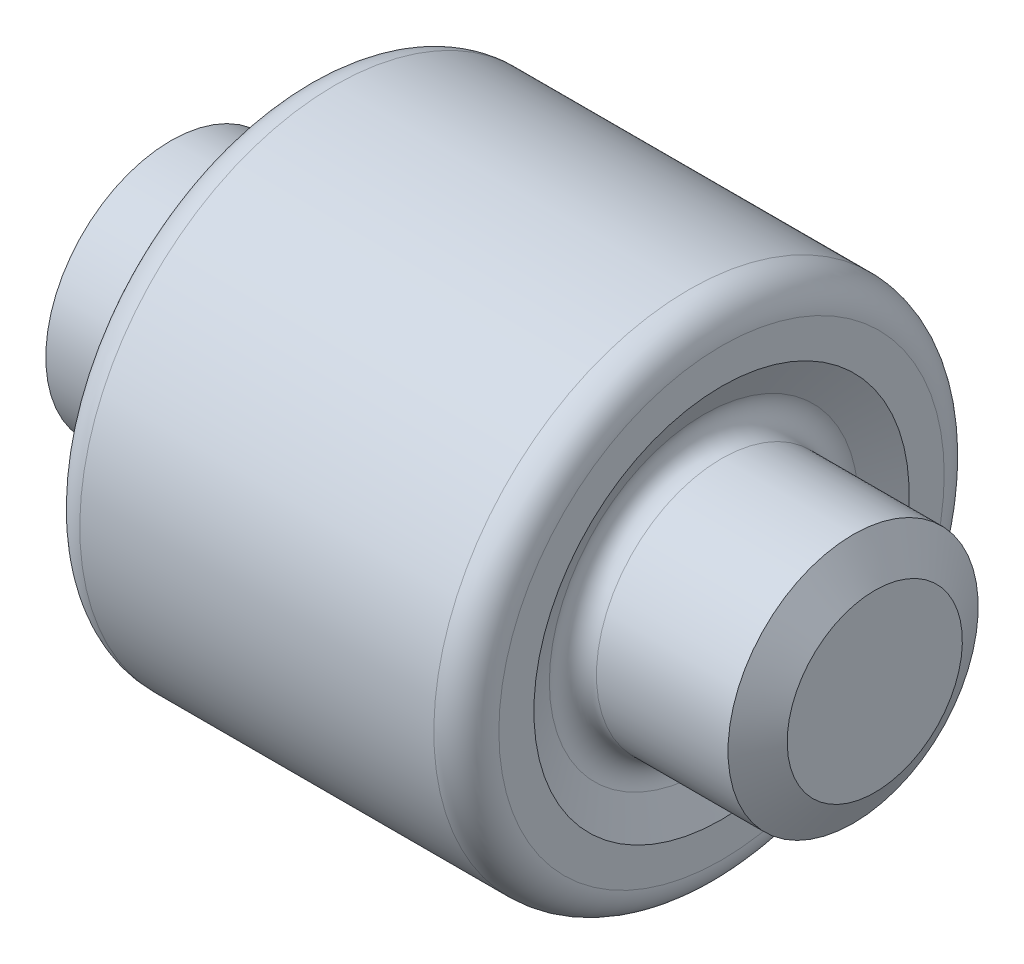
ISO-10303-21;
HEADER;
FILE_DESCRIPTION(('STEP AP214'),'2;1');
FILE_NAME('part.step','',(''),(''),'','','');
FILE_SCHEMA(('AUTOMOTIVE_DESIGN { 1 0 10303 214 1 1 1 1 }'));
ENDSEC;
DATA;
#1=APPLICATION_CONTEXT('core data for automotive mechanical design processes');
#2=APPLICATION_PROTOCOL_DEFINITION('international standard','automotive_design',2000,#1);
#3=PRODUCT_CONTEXT('',#1,'mechanical');
#4=PRODUCT('Part','Part','',(#3));
#5=PRODUCT_RELATED_PRODUCT_CATEGORY('part','',(#4));
#6=PRODUCT_DEFINITION_FORMATION('','',#4);
#7=PRODUCT_DEFINITION_CONTEXT('part definition',#1,'design');
#8=PRODUCT_DEFINITION('design','',#6,#7);
#9=PRODUCT_DEFINITION_SHAPE('','',#8);
#10=(LENGTH_UNIT() NAMED_UNIT(*) SI_UNIT(.MILLI.,.METRE.));
#11=(NAMED_UNIT(*) PLANE_ANGLE_UNIT() SI_UNIT($,.RADIAN.));
#12=(NAMED_UNIT(*) SI_UNIT($,.STERADIAN.) SOLID_ANGLE_UNIT());
#13=UNCERTAINTY_MEASURE_WITH_UNIT(LENGTH_MEASURE(1.E-05),#10,'distance_accuracy_value','');
#14=(GEOMETRIC_REPRESENTATION_CONTEXT(3) GLOBAL_UNCERTAINTY_ASSIGNED_CONTEXT((#13)) GLOBAL_UNIT_ASSIGNED_CONTEXT((#10,
#11,#12)) REPRESENTATION_CONTEXT('',''));
#15=CARTESIAN_POINT('',(0.,0.,0.));
#16=DIRECTION('',(0.,0.,1.));
#17=DIRECTION('',(1.,0.,0.));
#18=AXIS2_PLACEMENT_3D('',#15,#16,#17);
#19=CARTESIAN_POINT('',(14.5,0.,0.));
#20=DIRECTION('',(1.,0.,0.));
#21=DIRECTION('',(0.,1.,0.));
#22=AXIS2_PLACEMENT_3D('',#19,#20,#21);
#23=CYLINDRICAL_SURFACE('',#22,10.2);
#24=CARTESIAN_POINT('',(7.42499999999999,0.,0.));
#25=DIRECTION('',(1.,0.,0.));
#26=DIRECTION('',(0.,1.,0.));
#27=AXIS2_PLACEMENT_3D('',#24,#25,#26);
#28=CIRCLE('',#27,10.2);
#29=CARTESIAN_POINT('',(7.425,10.2,0.));
#30=VERTEX_POINT('',#29);
#31=EDGE_CURVE('E12',#30,#30,#28,.T.);
#32=ORIENTED_EDGE('',*,*,#31,.T.);
#33=EDGE_LOOP('',(#32));
#34=FACE_BOUND('',#33,.T.);
#35=CARTESIAN_POINT('',(21.575,0.,0.));
#36=DIRECTION('',(1.,0.,0.));
#37=DIRECTION('',(0.,1.,0.));
#38=AXIS2_PLACEMENT_3D('',#35,#36,#37);
#39=CIRCLE('',#38,10.2);
#40=CARTESIAN_POINT('',(21.575,10.2,0.));
#41=VERTEX_POINT('',#40);
#42=EDGE_CURVE('E68',#41,#41,#39,.T.);
#43=ORIENTED_EDGE('',*,*,#42,.F.);
#44=EDGE_LOOP('',(#43));
#45=FACE_BOUND('',#44,.T.);
#46=ADVANCED_FACE('F40',(#34,#45),#23,.T.);
#47=CARTESIAN_POINT('',(7.425,0.,0.));
#48=DIRECTION('',(1.,0.,0.));
#49=DIRECTION('',(0.,1.,0.));
#50=AXIS2_PLACEMENT_3D('',#47,#48,#49);
#51=TOROIDAL_SURFACE('',#50,8.9,1.3);
#52=CARTESIAN_POINT('',(6.12499999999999,0.,0.));
#53=DIRECTION('',(1.,0.,0.));
#54=DIRECTION('',(0.,1.,0.));
#55=AXIS2_PLACEMENT_3D('',#52,#53,#54);
#56=CIRCLE('',#55,8.9);
#57=CARTESIAN_POINT('',(6.125,8.9,0.));
#58=VERTEX_POINT('',#57);
#59=EDGE_CURVE('E46',#58,#58,#56,.T.);
#60=ORIENTED_EDGE('',*,*,#59,.T.);
#61=EDGE_LOOP('',(#60));
#62=FACE_BOUND('',#61,.T.);
#63=ORIENTED_EDGE('',*,*,#31,.F.);
#64=EDGE_LOOP('',(#63));
#65=FACE_BOUND('',#64,.T.);
#66=ADVANCED_FACE('F130',(#62,#65),#51,.T.);
#67=CARTESIAN_POINT('',(6.125,7.5,0.));
#68=DIRECTION('',(-1.,0.,0.));
#69=DIRECTION('',(0.,-1.,0.));
#70=AXIS2_PLACEMENT_3D('',#67,#68,#69);
#71=PLANE('',#70);
#72=CARTESIAN_POINT('',(6.12499999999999,0.,0.));
#73=DIRECTION('',(1.,0.,0.));
#74=DIRECTION('',(0.,1.,0.));
#75=AXIS2_PLACEMENT_3D('',#72,#73,#74);
#76=CIRCLE('',#75,7.5);
#77=CARTESIAN_POINT('',(6.125,7.5,0.));
#78=VERTEX_POINT('',#77);
#79=EDGE_CURVE('E50',#78,#78,#76,.T.);
#80=ORIENTED_EDGE('',*,*,#79,.T.);
#81=EDGE_LOOP('',(#80));
#82=FACE_BOUND('',#81,.T.);
#83=ORIENTED_EDGE('',*,*,#59,.F.);
#84=EDGE_LOOP('',(#83));
#85=FACE_BOUND('',#84,.T.);
#86=ADVANCED_FACE('F134',(#82,#85),#71,.T.);
#87=CARTESIAN_POINT('',(6.12499999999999,0.,0.));
#88=DIRECTION('',(-1.,0.,0.));
#89=DIRECTION('',(0.,-1.,0.));
#90=AXIS2_PLACEMENT_3D('',#87,#88,#89);
#91=CONICAL_SURFACE('',#90,7.5,1.08083900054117);
#92=CARTESIAN_POINT('',(6.83088235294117,0.,0.));
#93=DIRECTION('',(1.,0.,0.));
#94=DIRECTION('',(0.,1.,0.));
#95=AXIS2_PLACEMENT_3D('',#92,#93,#94);
#96=CIRCLE('',#95,6.1764705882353);
#97=CARTESIAN_POINT('',(6.83088235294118,6.17647058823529,0.));
#98=VERTEX_POINT('',#97);
#99=EDGE_CURVE('E54',#98,#98,#96,.T.);
#100=ORIENTED_EDGE('',*,*,#99,.T.);
#101=EDGE_LOOP('',(#100));
#102=FACE_BOUND('',#101,.T.);
#103=ORIENTED_EDGE('',*,*,#79,.F.);
#104=EDGE_LOOP('',(#103));
#105=FACE_BOUND('',#104,.T.);
#106=ADVANCED_FACE('F138',(#102,#105),#91,.F.);
#107=CARTESIAN_POINT('',(6.125,0.,0.));
#108=DIRECTION('',(1.,0.,0.));
#109=DIRECTION('',(0.,1.,0.));
#110=AXIS2_PLACEMENT_3D('',#107,#108,#109);
#111=TOROIDAL_SURFACE('',#110,5.8,0.799999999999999);
#112=CARTESIAN_POINT('',(6.125,0.,0.));
#113=DIRECTION('',(1.,0.,0.));
#114=DIRECTION('',(0.,1.,0.));
#115=AXIS2_PLACEMENT_3D('',#112,#113,#114);
#116=CIRCLE('',#115,5.);
#117=CARTESIAN_POINT('',(6.125,5.,0.));
#118=VERTEX_POINT('',#117);
#119=EDGE_CURVE('E59',#118,#118,#116,.T.);
#120=ORIENTED_EDGE('',*,*,#119,.T.);
#121=EDGE_LOOP('',(#120));
#122=FACE_BOUND('',#121,.T.);
#123=ORIENTED_EDGE('',*,*,#99,.F.);
#124=EDGE_LOOP('',(#123));
#125=FACE_BOUND('',#124,.T.);
#126=ADVANCED_FACE('F145',(#122,#125),#111,.F.);
#127=CARTESIAN_POINT('',(14.5,0.,0.));
#128=DIRECTION('',(1.,0.,0.));
#129=DIRECTION('',(0.,1.,0.));
#130=AXIS2_PLACEMENT_3D('',#127,#128,#129);
#131=CYLINDRICAL_SURFACE('',#130,5.);
#132=CARTESIAN_POINT('',(0.866025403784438,0.,0.));
#133=DIRECTION('',(1.,0.,0.));
#134=DIRECTION('',(0.,1.,0.));
#135=AXIS2_PLACEMENT_3D('',#132,#133,#134);
#136=CIRCLE('',#135,5.);
#137=CARTESIAN_POINT('',(0.86602540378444,5.,0.));
#138=VERTEX_POINT('',#137);
#139=EDGE_CURVE('E62',#138,#138,#136,.T.);
#140=ORIENTED_EDGE('',*,*,#139,.T.);
#141=EDGE_LOOP('',(#140));
#142=FACE_BOUND('',#141,.T.);
#143=ORIENTED_EDGE('',*,*,#119,.F.);
#144=EDGE_LOOP('',(#143));
#145=FACE_BOUND('',#144,.T.);
#146=ADVANCED_FACE('F149',(#142,#145),#131,.T.);
#147=CARTESIAN_POINT('',(0.866025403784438,0.,0.));
#148=DIRECTION('',(1.,0.,0.));
#149=DIRECTION('',(0.,1.,0.));
#150=AXIS2_PLACEMENT_3D('',#147,#148,#149);
#151=CONICAL_SURFACE('',#150,5.,1.0471975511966);
#152=CARTESIAN_POINT('',(0.,0.,0.));
#153=DIRECTION('',(1.,0.,0.));
#154=DIRECTION('',(0.,1.,0.));
#155=AXIS2_PLACEMENT_3D('',#152,#153,#154);
#156=CIRCLE('',#155,3.5);
#157=CARTESIAN_POINT('',(0.,3.5,0.));
#158=VERTEX_POINT('',#157);
#159=EDGE_CURVE('E65',#158,#158,#156,.T.);
#160=ORIENTED_EDGE('',*,*,#159,.T.);
#161=EDGE_LOOP('',(#160));
#162=FACE_BOUND('',#161,.T.);
#163=ORIENTED_EDGE('',*,*,#139,.F.);
#164=EDGE_LOOP('',(#163));
#165=FACE_BOUND('',#164,.T.);
#166=ADVANCED_FACE('F153',(#162,#165),#151,.T.);
#167=CARTESIAN_POINT('',(0.,0.,0.));
#168=DIRECTION('',(-1.,0.,0.));
#169=DIRECTION('',(0.,-1.,0.));
#170=AXIS2_PLACEMENT_3D('',#167,#168,#169);
#171=PLANE('',#170);
#172=ORIENTED_EDGE('',*,*,#159,.F.);
#173=EDGE_LOOP('',(#172));
#174=FACE_BOUND('',#173,.T.);
#175=ADVANCED_FACE('F125',(#174),#171,.T.);
#176=CARTESIAN_POINT('',(21.575,0.,0.));
#177=DIRECTION('',(-1.,0.,0.));
#178=DIRECTION('',(0.,1.,0.));
#179=AXIS2_PLACEMENT_3D('',#176,#177,#178);
#180=TOROIDAL_SURFACE('',#179,8.9,1.3);
#181=CARTESIAN_POINT('',(22.875,0.,0.));
#182=DIRECTION('',(1.,0.,0.));
#183=DIRECTION('',(0.,1.,0.));
#184=AXIS2_PLACEMENT_3D('',#181,#182,#183);
#185=CIRCLE('',#184,8.9);
#186=CARTESIAN_POINT('',(22.875,8.89999999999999,0.));
#187=VERTEX_POINT('',#186);
#188=EDGE_CURVE('E71',#187,#187,#185,.T.);
#189=ORIENTED_EDGE('',*,*,#188,.F.);
#190=EDGE_LOOP('',(#189));
#191=FACE_BOUND('',#190,.T.);
#192=ORIENTED_EDGE('',*,*,#42,.T.);
#193=EDGE_LOOP('',(#192));
#194=FACE_BOUND('',#193,.T.);
#195=ADVANCED_FACE('F119',(#191,#194),#180,.T.);
#196=CARTESIAN_POINT('',(22.875,7.49999999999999,0.));
#197=DIRECTION('',(1.,0.,0.));
#198=DIRECTION('',(0.,-1.,0.));
#199=AXIS2_PLACEMENT_3D('',#196,#197,#198);
#200=PLANE('',#199);
#201=CARTESIAN_POINT('',(22.875,0.,0.));
#202=DIRECTION('',(1.,0.,0.));
#203=DIRECTION('',(0.,1.,0.));
#204=AXIS2_PLACEMENT_3D('',#201,#202,#203);
#205=CIRCLE('',#204,7.5);
#206=CARTESIAN_POINT('',(22.875,7.49999999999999,0.));
#207=VERTEX_POINT('',#206);
#208=EDGE_CURVE('E74',#207,#207,#205,.T.);
#209=ORIENTED_EDGE('',*,*,#208,.F.);
#210=EDGE_LOOP('',(#209));
#211=FACE_BOUND('',#210,.T.);
#212=ORIENTED_EDGE('',*,*,#188,.T.);
#213=EDGE_LOOP('',(#212));
#214=FACE_BOUND('',#213,.T.);
#215=ADVANCED_FACE('F113',(#211,#214),#200,.T.);
#216=CARTESIAN_POINT('',(22.875,0.,0.));
#217=DIRECTION('',(1.,0.,0.));
#218=DIRECTION('',(0.,-1.,0.));
#219=AXIS2_PLACEMENT_3D('',#216,#217,#218);
#220=CONICAL_SURFACE('',#219,7.5,1.08083900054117);
#221=CARTESIAN_POINT('',(22.1691176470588,0.,0.));
#222=DIRECTION('',(1.,0.,0.));
#223=DIRECTION('',(0.,1.,0.));
#224=AXIS2_PLACEMENT_3D('',#221,#222,#223);
#225=CIRCLE('',#224,6.1764705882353);
#226=CARTESIAN_POINT('',(22.1691176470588,6.17647058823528,0.));
#227=VERTEX_POINT('',#226);
#228=EDGE_CURVE('E77',#227,#227,#225,.T.);
#229=ORIENTED_EDGE('',*,*,#228,.F.);
#230=EDGE_LOOP('',(#229));
#231=FACE_BOUND('',#230,.T.);
#232=ORIENTED_EDGE('',*,*,#208,.T.);
#233=EDGE_LOOP('',(#232));
#234=FACE_BOUND('',#233,.T.);
#235=ADVANCED_FACE('F107',(#231,#234),#220,.F.);
#236=CARTESIAN_POINT('',(22.875,0.,0.));
#237=DIRECTION('',(-1.,0.,0.));
#238=DIRECTION('',(0.,1.,0.));
#239=AXIS2_PLACEMENT_3D('',#236,#237,#238);
#240=TOROIDAL_SURFACE('',#239,5.8,0.799999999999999);
#241=CARTESIAN_POINT('',(22.875,0.,0.));
#242=DIRECTION('',(1.,0.,0.));
#243=DIRECTION('',(0.,1.,0.));
#244=AXIS2_PLACEMENT_3D('',#241,#242,#243);
#245=CIRCLE('',#244,5.);
#246=CARTESIAN_POINT('',(22.875,4.99999999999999,0.));
#247=VERTEX_POINT('',#246);
#248=EDGE_CURVE('E80',#247,#247,#245,.T.);
#249=ORIENTED_EDGE('',*,*,#248,.F.);
#250=EDGE_LOOP('',(#249));
#251=FACE_BOUND('',#250,.T.);
#252=ORIENTED_EDGE('',*,*,#228,.T.);
#253=EDGE_LOOP('',(#252));
#254=FACE_BOUND('',#253,.T.);
#255=ADVANCED_FACE('F101',(#251,#254),#240,.F.);
#256=CARTESIAN_POINT('',(14.5,0.,0.));
#257=DIRECTION('',(-1.,0.,0.));
#258=DIRECTION('',(0.,1.,0.));
#259=AXIS2_PLACEMENT_3D('',#256,#257,#258);
#260=CYLINDRICAL_SURFACE('',#259,5.);
#261=CARTESIAN_POINT('',(28.1339745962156,0.,0.));
#262=DIRECTION('',(1.,0.,0.));
#263=DIRECTION('',(0.,1.,0.));
#264=AXIS2_PLACEMENT_3D('',#261,#262,#263);
#265=CIRCLE('',#264,5.);
#266=CARTESIAN_POINT('',(28.1339745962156,4.99999999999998,0.));
#267=VERTEX_POINT('',#266);
#268=EDGE_CURVE('E83',#267,#267,#265,.T.);
#269=ORIENTED_EDGE('',*,*,#268,.F.);
#270=EDGE_LOOP('',(#269));
#271=FACE_BOUND('',#270,.T.);
#272=ORIENTED_EDGE('',*,*,#248,.T.);
#273=EDGE_LOOP('',(#272));
#274=FACE_BOUND('',#273,.T.);
#275=ADVANCED_FACE('F95',(#271,#274),#260,.T.);
#276=CARTESIAN_POINT('',(28.1339745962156,0.,0.));
#277=DIRECTION('',(-1.,0.,0.));
#278=DIRECTION('',(0.,1.,0.));
#279=AXIS2_PLACEMENT_3D('',#276,#277,#278);
#280=CONICAL_SURFACE('',#279,5.,1.0471975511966);
#281=CARTESIAN_POINT('',(29.,0.,0.));
#282=DIRECTION('',(1.,0.,0.));
#283=DIRECTION('',(0.,1.,0.));
#284=AXIS2_PLACEMENT_3D('',#281,#282,#283);
#285=CIRCLE('',#284,3.5);
#286=CARTESIAN_POINT('',(29.,3.49999999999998,0.));
#287=VERTEX_POINT('',#286);
#288=EDGE_CURVE('E86',#287,#287,#285,.T.);
#289=ORIENTED_EDGE('',*,*,#288,.F.);
#290=EDGE_LOOP('',(#289));
#291=FACE_BOUND('',#290,.T.);
#292=ORIENTED_EDGE('',*,*,#268,.T.);
#293=EDGE_LOOP('',(#292));
#294=FACE_BOUND('',#293,.T.);
#295=ADVANCED_FACE('F92',(#291,#294),#280,.T.);
#296=CARTESIAN_POINT('',(29.,0.,0.));
#297=DIRECTION('',(1.,0.,0.));
#298=DIRECTION('',(0.,-1.,0.));
#299=AXIS2_PLACEMENT_3D('',#296,#297,#298);
#300=PLANE('',#299);
#301=ORIENTED_EDGE('',*,*,#288,.T.);
#302=EDGE_LOOP('',(#301));
#303=FACE_BOUND('',#302,.T.);
#304=ADVANCED_FACE('F90',(#303),#300,.T.);
#305=CLOSED_SHELL('',(#46,#66,#86,#106,#126,#146,#166,#175,#195,#215,#235,#255,#275,#295,#304));
#306=MANIFOLD_SOLID_BREP('B2',#305);
#307=ADVANCED_BREP_SHAPE_REPRESENTATION('',(#18,#306),#14);
#308=SHAPE_DEFINITION_REPRESENTATION(#9,#307);
ENDSEC;
END-ISO-10303-21;
